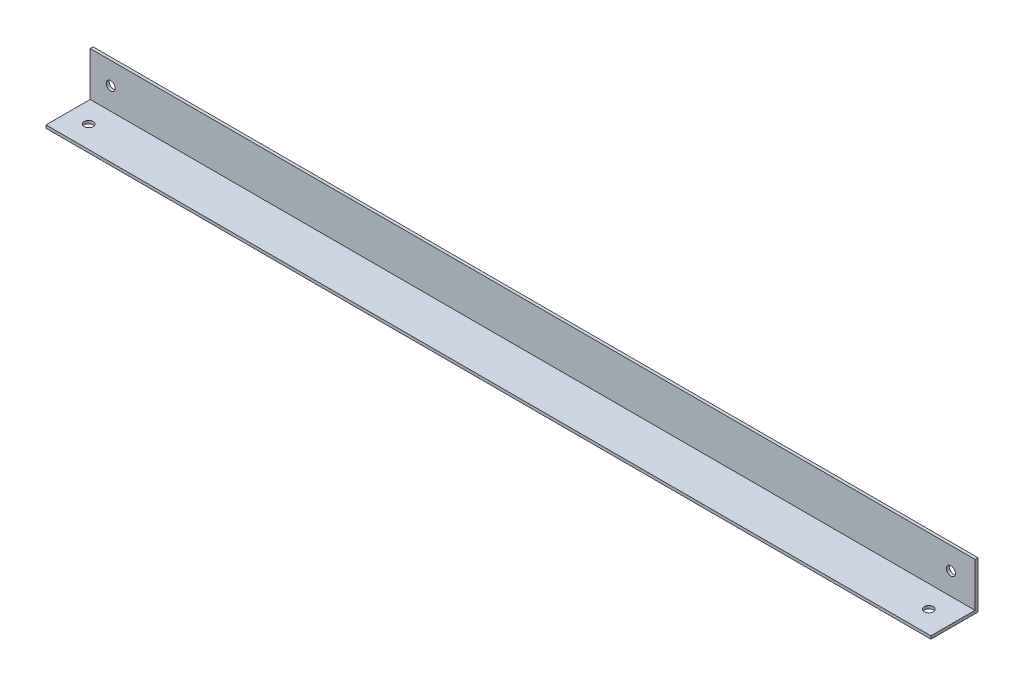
from build123d import *

# Parameters (mm, degrees)
BOSS_EXTRUDE1_DEPTH = 238.76
SKETCH2_R           = 2.4257
CUT_EXTRUDE1_DEPTH  = 242.447007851


with BuildPart() as part:
    # Sketch1 → Boss-Extrude1 (new, symmetric)
    with BuildSketch(Plane.YZ):
        Polygon((0, 0), (25.4, 0), (25.4, 1.5875), (1.5875, 1.5875), (1.5875, 25.4), (0, 25.4), align=None)
    extrude(amount=BOSS_EXTRUDE1_DEPTH, both=True)

    # Sketch2 → Cut-Extrude1 (cut, through all)
    with BuildSketch(Plane(origin=(0, 0, 0), x_dir=(-1, 0, 0), z_dir=(0, 1, 0))):
        with Locations(Location((-225.7425, 13.49375, 0), (0, 0, 270))):
            Circle(SKETCH2_R)
        with Locations(Location((227.6475, 13.49375, 0), (0, 0, 270))):
            Circle(SKETCH2_R)
    cut_extrude1 = extrude(amount=CUT_EXTRUDE1_DEPTH, mode=Mode.SUBTRACT)

    # Mirror1: Cut-Extrude1 across plane
    add(cut_extrude1.mirror(Plane(origin=(0, 0, 0), x_dir=(0, 0.7071067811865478, 0.7071067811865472), z_dir=(0, -0.7071067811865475, 0.7071067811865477))), mode=Mode.SUBTRACT)


solid = part.part
